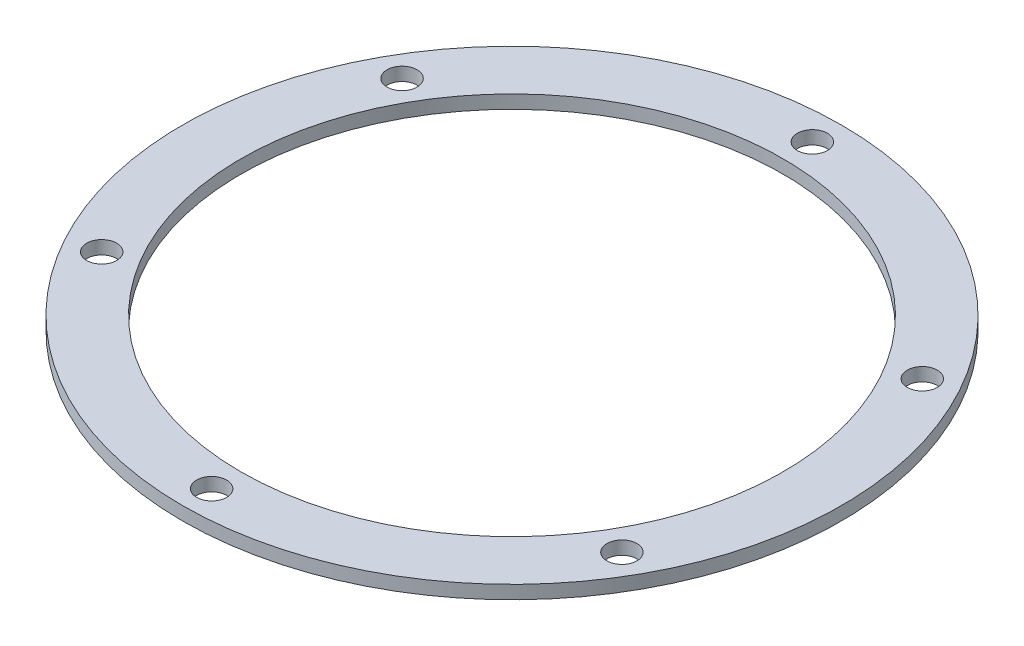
ISO-10303-21;
HEADER;
FILE_DESCRIPTION(('STEP AP214'),'2;1');
FILE_NAME('part.step','',(''),(''),'','','');
FILE_SCHEMA(('AUTOMOTIVE_DESIGN { 1 0 10303 214 1 1 1 1 }'));
ENDSEC;
DATA;
#1=APPLICATION_CONTEXT('core data for automotive mechanical design processes');
#2=APPLICATION_PROTOCOL_DEFINITION('international standard','automotive_design',2000,#1);
#3=PRODUCT_CONTEXT('',#1,'mechanical');
#4=PRODUCT('Part','Part','',(#3));
#5=PRODUCT_RELATED_PRODUCT_CATEGORY('part','',(#4));
#6=PRODUCT_DEFINITION_FORMATION('','',#4);
#7=PRODUCT_DEFINITION_CONTEXT('part definition',#1,'design');
#8=PRODUCT_DEFINITION('design','',#6,#7);
#9=PRODUCT_DEFINITION_SHAPE('','',#8);
#10=(LENGTH_UNIT() NAMED_UNIT(*) SI_UNIT(.MILLI.,.METRE.));
#11=(NAMED_UNIT(*) PLANE_ANGLE_UNIT() SI_UNIT($,.RADIAN.));
#12=(NAMED_UNIT(*) SI_UNIT($,.STERADIAN.) SOLID_ANGLE_UNIT());
#13=UNCERTAINTY_MEASURE_WITH_UNIT(LENGTH_MEASURE(1.E-05),#10,'distance_accuracy_value','');
#14=(GEOMETRIC_REPRESENTATION_CONTEXT(3) GLOBAL_UNCERTAINTY_ASSIGNED_CONTEXT((#13)) GLOBAL_UNIT_ASSIGNED_CONTEXT((#10,
#11,#12)) REPRESENTATION_CONTEXT('',''));
#15=CARTESIAN_POINT('',(0.,0.,0.));
#16=DIRECTION('',(0.,0.,1.));
#17=DIRECTION('',(1.,0.,0.));
#18=AXIS2_PLACEMENT_3D('',#15,#16,#17);
#19=CARTESIAN_POINT('',(0.,12.5902807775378,0.));
#20=DIRECTION('',(0.,1.,0.));
#21=DIRECTION('',(0.,0.,1.));
#22=AXIS2_PLACEMENT_3D('',#19,#20,#21);
#23=CYLINDRICAL_SURFACE('',#22,197.5);
#24=CARTESIAN_POINT('',(0.,-6.99460043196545,0.));
#25=DIRECTION('',(0.,1.,0.));
#26=DIRECTION('',(0.,0.,1.));
#27=AXIS2_PLACEMENT_3D('',#24,#25,#26);
#28=CIRCLE('',#27,197.5);
#29=CARTESIAN_POINT('',(0.,-6.99460043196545,197.5));
#30=VERTEX_POINT('',#29);
#31=EDGE_CURVE('E50',#30,#30,#28,.T.);
#32=ORIENTED_EDGE('',*,*,#31,.T.);
#33=EDGE_LOOP('',(#32));
#34=FACE_BOUND('',#33,.T.);
#35=CARTESIAN_POINT('',(0.,1.00539956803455,0.));
#36=DIRECTION('',(0.,1.,0.));
#37=DIRECTION('',(0.,0.,1.));
#38=AXIS2_PLACEMENT_3D('',#35,#36,#37);
#39=CIRCLE('',#38,197.5);
#40=CARTESIAN_POINT('',(0.,1.00539956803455,197.5));
#41=VERTEX_POINT('',#40);
#42=EDGE_CURVE('E10',#41,#41,#39,.T.);
#43=ORIENTED_EDGE('',*,*,#42,.F.);
#44=EDGE_LOOP('',(#43));
#45=FACE_BOUND('',#44,.T.);
#46=ADVANCED_FACE('F31',(#34,#45),#23,.T.);
#47=CARTESIAN_POINT('',(-197.5,1.00539956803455,0.));
#48=DIRECTION('',(0.,1.,0.));
#49=DIRECTION('',(0.,0.,1.));
#50=AXIS2_PLACEMENT_3D('',#47,#48,#49);
#51=PLANE('',#50);
#52=CARTESIAN_POINT('',(-155.884572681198,1.00539956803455,-90.0000000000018));
#53=DIRECTION('',(0.,1.,0.));
#54=DIRECTION('',(0.,0.,1.));
#55=AXIS2_PLACEMENT_3D('',#52,#53,#54);
#56=CIRCLE('',#55,9.);
#57=CARTESIAN_POINT('',(-155.884572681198,1.00539956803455,-81.0000000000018));
#58=VERTEX_POINT('',#57);
#59=EDGE_CURVE('E75',#58,#58,#56,.T.);
#60=ORIENTED_EDGE('',*,*,#59,.F.);
#61=EDGE_LOOP('',(#60));
#62=FACE_BOUND('',#61,.T.);
#63=CARTESIAN_POINT('',(-155.8845726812,1.00539956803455,89.9999999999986));
#64=DIRECTION('',(0.,1.,0.));
#65=DIRECTION('',(0.,0.,1.));
#66=AXIS2_PLACEMENT_3D('',#63,#64,#65);
#67=CIRCLE('',#66,8.99999999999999);
#68=CARTESIAN_POINT('',(-155.8845726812,1.00539956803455,98.9999999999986));
#69=VERTEX_POINT('',#68);
#70=EDGE_CURVE('E65',#69,#69,#67,.T.);
#71=ORIENTED_EDGE('',*,*,#70,.F.);
#72=EDGE_LOOP('',(#71));
#73=FACE_BOUND('',#72,.T.);
#74=CARTESIAN_POINT('',(-1.25693400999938E-12,1.00539956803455,180.));
#75=DIRECTION('',(0.,1.,0.));
#76=DIRECTION('',(0.,0.,1.));
#77=AXIS2_PLACEMENT_3D('',#74,#75,#76);
#78=CIRCLE('',#77,9.);
#79=CARTESIAN_POINT('',(-1.25693400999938E-12,1.00539956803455,189.));
#80=VERTEX_POINT('',#79);
#81=EDGE_CURVE('E62',#80,#80,#78,.T.);
#82=ORIENTED_EDGE('',*,*,#81,.F.);
#83=EDGE_LOOP('',(#82));
#84=FACE_BOUND('',#83,.T.);
#85=CARTESIAN_POINT('',(155.884572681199,1.00539956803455,90.0000000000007));
#86=DIRECTION('',(0.,1.,0.));
#87=DIRECTION('',(0.,0.,1.));
#88=AXIS2_PLACEMENT_3D('',#85,#86,#87);
#89=CIRCLE('',#88,9.00000000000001);
#90=CARTESIAN_POINT('',(155.884572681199,1.00539956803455,99.0000000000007));
#91=VERTEX_POINT('',#90);
#92=EDGE_CURVE('E59',#91,#91,#89,.T.);
#93=ORIENTED_EDGE('',*,*,#92,.F.);
#94=EDGE_LOOP('',(#93));
#95=FACE_BOUND('',#94,.T.);
#96=CARTESIAN_POINT('',(155.884572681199,1.00539956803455,-89.9999999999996));
#97=DIRECTION('',(0.,1.,0.));
#98=DIRECTION('',(0.,0.,1.));
#99=AXIS2_PLACEMENT_3D('',#96,#97,#98);
#100=CIRCLE('',#99,9.00000000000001);
#101=CARTESIAN_POINT('',(155.884572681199,1.00539956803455,-80.9999999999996));
#102=VERTEX_POINT('',#101);
#103=EDGE_CURVE('E55',#102,#102,#100,.T.);
#104=ORIENTED_EDGE('',*,*,#103,.F.);
#105=EDGE_LOOP('',(#104));
#106=FACE_BOUND('',#105,.T.);
#107=CARTESIAN_POINT('',(0.,1.00539956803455,-180.));
#108=DIRECTION('',(0.,1.,0.));
#109=DIRECTION('',(0.,0.,1.));
#110=AXIS2_PLACEMENT_3D('',#107,#108,#109);
#111=CIRCLE('',#110,9.);
#112=CARTESIAN_POINT('',(0.,1.00539956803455,-171.));
#113=VERTEX_POINT('',#112);
#114=EDGE_CURVE('E51',#113,#113,#111,.T.);
#115=ORIENTED_EDGE('',*,*,#114,.F.);
#116=EDGE_LOOP('',(#115));
#117=FACE_BOUND('',#116,.T.);
#118=ORIENTED_EDGE('',*,*,#42,.T.);
#119=EDGE_LOOP('',(#118));
#120=FACE_BOUND('',#119,.T.);
#121=CARTESIAN_POINT('',(0.,1.00539956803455,0.));
#122=DIRECTION('',(0.,1.,0.));
#123=DIRECTION('',(0.,0.,1.));
#124=AXIS2_PLACEMENT_3D('',#121,#122,#123);
#125=CIRCLE('',#124,162.5);
#126=CARTESIAN_POINT('',(0.,1.00539956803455,162.5));
#127=VERTEX_POINT('',#126);
#128=EDGE_CURVE('E38',#127,#127,#125,.T.);
#129=ORIENTED_EDGE('',*,*,#128,.F.);
#130=EDGE_LOOP('',(#129));
#131=FACE_BOUND('',#130,.T.);
#132=ADVANCED_FACE('F93',(#62,#73,#84,#95,#106,#117,#120,#131),#51,.T.);
#133=CARTESIAN_POINT('',(0.,12.5902807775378,0.));
#134=DIRECTION('',(0.,1.,0.));
#135=DIRECTION('',(0.,0.,1.));
#136=AXIS2_PLACEMENT_3D('',#133,#134,#135);
#137=CYLINDRICAL_SURFACE('',#136,162.5);
#138=ORIENTED_EDGE('',*,*,#128,.T.);
#139=EDGE_LOOP('',(#138));
#140=FACE_BOUND('',#139,.T.);
#141=CARTESIAN_POINT('',(0.,-6.99460043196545,0.));
#142=DIRECTION('',(0.,1.,0.));
#143=DIRECTION('',(0.,0.,1.));
#144=AXIS2_PLACEMENT_3D('',#141,#142,#143);
#145=CIRCLE('',#144,162.5);
#146=CARTESIAN_POINT('',(0.,-6.99460043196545,162.5));
#147=VERTEX_POINT('',#146);
#148=EDGE_CURVE('E43',#147,#147,#145,.T.);
#149=ORIENTED_EDGE('',*,*,#148,.F.);
#150=EDGE_LOOP('',(#149));
#151=FACE_BOUND('',#150,.T.);
#152=ADVANCED_FACE('F91',(#140,#151),#137,.F.);
#153=CARTESIAN_POINT('',(-162.5,-6.99460043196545,0.));
#154=DIRECTION('',(0.,-1.,0.));
#155=DIRECTION('',(0.,0.,-1.));
#156=AXIS2_PLACEMENT_3D('',#153,#154,#155);
#157=PLANE('',#156);
#158=CARTESIAN_POINT('',(-155.884572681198,-6.99460043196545,-90.0000000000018));
#159=DIRECTION('',(0.,-1.,0.));
#160=DIRECTION('',(0.,0.,-1.));
#161=AXIS2_PLACEMENT_3D('',#158,#159,#160);
#162=CIRCLE('',#161,9.);
#163=CARTESIAN_POINT('',(-155.884572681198,-6.99460043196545,-99.0000000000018));
#164=VERTEX_POINT('',#163);
#165=EDGE_CURVE('E34',#164,#164,#162,.T.);
#166=ORIENTED_EDGE('',*,*,#165,.F.);
#167=EDGE_LOOP('',(#166));
#168=FACE_BOUND('',#167,.T.);
#169=CARTESIAN_POINT('',(-155.8845726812,-6.99460043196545,89.9999999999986));
#170=DIRECTION('',(0.,-1.,0.));
#171=DIRECTION('',(0.,0.,-1.));
#172=AXIS2_PLACEMENT_3D('',#169,#170,#171);
#173=CIRCLE('',#172,8.99999999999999);
#174=CARTESIAN_POINT('',(-155.8845726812,-6.99460043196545,80.9999999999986));
#175=VERTEX_POINT('',#174);
#176=EDGE_CURVE('E63',#175,#175,#173,.T.);
#177=ORIENTED_EDGE('',*,*,#176,.F.);
#178=EDGE_LOOP('',(#177));
#179=FACE_BOUND('',#178,.T.);
#180=CARTESIAN_POINT('',(-1.25693400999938E-12,-6.99460043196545,180.));
#181=DIRECTION('',(0.,-1.,0.));
#182=DIRECTION('',(0.,0.,-1.));
#183=AXIS2_PLACEMENT_3D('',#180,#181,#182);
#184=CIRCLE('',#183,9.);
#185=CARTESIAN_POINT('',(-1.25693400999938E-12,-6.99460043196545,171.));
#186=VERTEX_POINT('',#185);
#187=EDGE_CURVE('E60',#186,#186,#184,.T.);
#188=ORIENTED_EDGE('',*,*,#187,.F.);
#189=EDGE_LOOP('',(#188));
#190=FACE_BOUND('',#189,.T.);
#191=CARTESIAN_POINT('',(155.884572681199,-6.99460043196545,90.0000000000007));
#192=DIRECTION('',(0.,-1.,0.));
#193=DIRECTION('',(0.,0.,-1.));
#194=AXIS2_PLACEMENT_3D('',#191,#192,#193);
#195=CIRCLE('',#194,9.00000000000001);
#196=CARTESIAN_POINT('',(155.884572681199,-6.99460043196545,81.0000000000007));
#197=VERTEX_POINT('',#196);
#198=EDGE_CURVE('E56',#197,#197,#195,.T.);
#199=ORIENTED_EDGE('',*,*,#198,.F.);
#200=EDGE_LOOP('',(#199));
#201=FACE_BOUND('',#200,.T.);
#202=CARTESIAN_POINT('',(155.884572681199,-6.99460043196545,-89.9999999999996));
#203=DIRECTION('',(0.,-1.,0.));
#204=DIRECTION('',(0.,0.,-1.));
#205=AXIS2_PLACEMENT_3D('',#202,#203,#204);
#206=CIRCLE('',#205,9.00000000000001);
#207=CARTESIAN_POINT('',(155.884572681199,-6.99460043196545,-98.9999999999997));
#208=VERTEX_POINT('',#207);
#209=EDGE_CURVE('E52',#208,#208,#206,.T.);
#210=ORIENTED_EDGE('',*,*,#209,.F.);
#211=EDGE_LOOP('',(#210));
#212=FACE_BOUND('',#211,.T.);
#213=CARTESIAN_POINT('',(0.,-6.99460043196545,-180.));
#214=DIRECTION('',(0.,-1.,0.));
#215=DIRECTION('',(0.,0.,-1.));
#216=AXIS2_PLACEMENT_3D('',#213,#214,#215);
#217=CIRCLE('',#216,9.);
#218=CARTESIAN_POINT('',(0.,-6.99460043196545,-189.));
#219=VERTEX_POINT('',#218);
#220=EDGE_CURVE('E47',#219,#219,#217,.T.);
#221=ORIENTED_EDGE('',*,*,#220,.F.);
#222=EDGE_LOOP('',(#221));
#223=FACE_BOUND('',#222,.T.);
#224=ORIENTED_EDGE('',*,*,#148,.T.);
#225=EDGE_LOOP('',(#224));
#226=FACE_BOUND('',#225,.T.);
#227=ORIENTED_EDGE('',*,*,#31,.F.);
#228=EDGE_LOOP('',(#227));
#229=FACE_BOUND('',#228,.T.);
#230=ADVANCED_FACE('F88',(#168,#179,#190,#201,#212,#223,#226,#229),#157,.T.);
#231=CARTESIAN_POINT('',(0.,-8.99460043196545,-180.));
#232=DIRECTION('',(0.,1.,0.));
#233=DIRECTION('',(0.,0.,1.));
#234=AXIS2_PLACEMENT_3D('',#231,#232,#233);
#235=CYLINDRICAL_SURFACE('',#234,9.);
#236=ORIENTED_EDGE('',*,*,#220,.T.);
#237=EDGE_LOOP('',(#236));
#238=FACE_BOUND('',#237,.T.);
#239=ORIENTED_EDGE('',*,*,#114,.T.);
#240=EDGE_LOOP('',(#239));
#241=FACE_BOUND('',#240,.T.);
#242=ADVANCED_FACE('F100',(#238,#241),#235,.F.);
#243=CARTESIAN_POINT('',(155.884572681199,-8.99460043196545,-89.9999999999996));
#244=DIRECTION('',(0.,1.,0.));
#245=DIRECTION('',(0.,0.,1.));
#246=AXIS2_PLACEMENT_3D('',#243,#244,#245);
#247=CYLINDRICAL_SURFACE('',#246,9.00000000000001);
#248=ORIENTED_EDGE('',*,*,#209,.T.);
#249=EDGE_LOOP('',(#248));
#250=FACE_BOUND('',#249,.T.);
#251=ORIENTED_EDGE('',*,*,#103,.T.);
#252=EDGE_LOOP('',(#251));
#253=FACE_BOUND('',#252,.T.);
#254=ADVANCED_FACE('F131',(#250,#253),#247,.F.);
#255=CARTESIAN_POINT('',(155.884572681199,-8.99460043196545,90.0000000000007));
#256=DIRECTION('',(0.,1.,0.));
#257=DIRECTION('',(0.,0.,1.));
#258=AXIS2_PLACEMENT_3D('',#255,#256,#257);
#259=CYLINDRICAL_SURFACE('',#258,9.00000000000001);
#260=ORIENTED_EDGE('',*,*,#198,.T.);
#261=EDGE_LOOP('',(#260));
#262=FACE_BOUND('',#261,.T.);
#263=ORIENTED_EDGE('',*,*,#92,.T.);
#264=EDGE_LOOP('',(#263));
#265=FACE_BOUND('',#264,.T.);
#266=ADVANCED_FACE('F141',(#262,#265),#259,.F.);
#267=CARTESIAN_POINT('',(-1.25693400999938E-12,-8.99460043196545,180.));
#268=DIRECTION('',(0.,1.,0.));
#269=DIRECTION('',(0.,0.,1.));
#270=AXIS2_PLACEMENT_3D('',#267,#268,#269);
#271=CYLINDRICAL_SURFACE('',#270,9.);
#272=ORIENTED_EDGE('',*,*,#187,.T.);
#273=EDGE_LOOP('',(#272));
#274=FACE_BOUND('',#273,.T.);
#275=ORIENTED_EDGE('',*,*,#81,.T.);
#276=EDGE_LOOP('',(#275));
#277=FACE_BOUND('',#276,.T.);
#278=ADVANCED_FACE('F151',(#274,#277),#271,.F.);
#279=CARTESIAN_POINT('',(-155.8845726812,-8.99460043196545,89.9999999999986));
#280=DIRECTION('',(0.,1.,0.));
#281=DIRECTION('',(0.,0.,1.));
#282=AXIS2_PLACEMENT_3D('',#279,#280,#281);
#283=CYLINDRICAL_SURFACE('',#282,8.99999999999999);
#284=ORIENTED_EDGE('',*,*,#176,.T.);
#285=EDGE_LOOP('',(#284));
#286=FACE_BOUND('',#285,.T.);
#287=ORIENTED_EDGE('',*,*,#70,.T.);
#288=EDGE_LOOP('',(#287));
#289=FACE_BOUND('',#288,.T.);
#290=ADVANCED_FACE('F161',(#286,#289),#283,.F.);
#291=CARTESIAN_POINT('',(-155.884572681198,-8.99460043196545,-90.0000000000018));
#292=DIRECTION('',(0.,1.,0.));
#293=DIRECTION('',(0.,0.,1.));
#294=AXIS2_PLACEMENT_3D('',#291,#292,#293);
#295=CYLINDRICAL_SURFACE('',#294,9.);
#296=ORIENTED_EDGE('',*,*,#165,.T.);
#297=EDGE_LOOP('',(#296));
#298=FACE_BOUND('',#297,.T.);
#299=ORIENTED_EDGE('',*,*,#59,.T.);
#300=EDGE_LOOP('',(#299));
#301=FACE_BOUND('',#300,.T.);
#302=ADVANCED_FACE('F171',(#298,#301),#295,.F.);
#303=CLOSED_SHELL('',(#46,#132,#152,#230,#242,#254,#266,#278,#290,#302));
#304=MANIFOLD_SOLID_BREP('B2',#303);
#305=ADVANCED_BREP_SHAPE_REPRESENTATION('',(#18,#304),#14);
#306=SHAPE_DEFINITION_REPRESENTATION(#9,#305);
ENDSEC;
END-ISO-10303-21;
